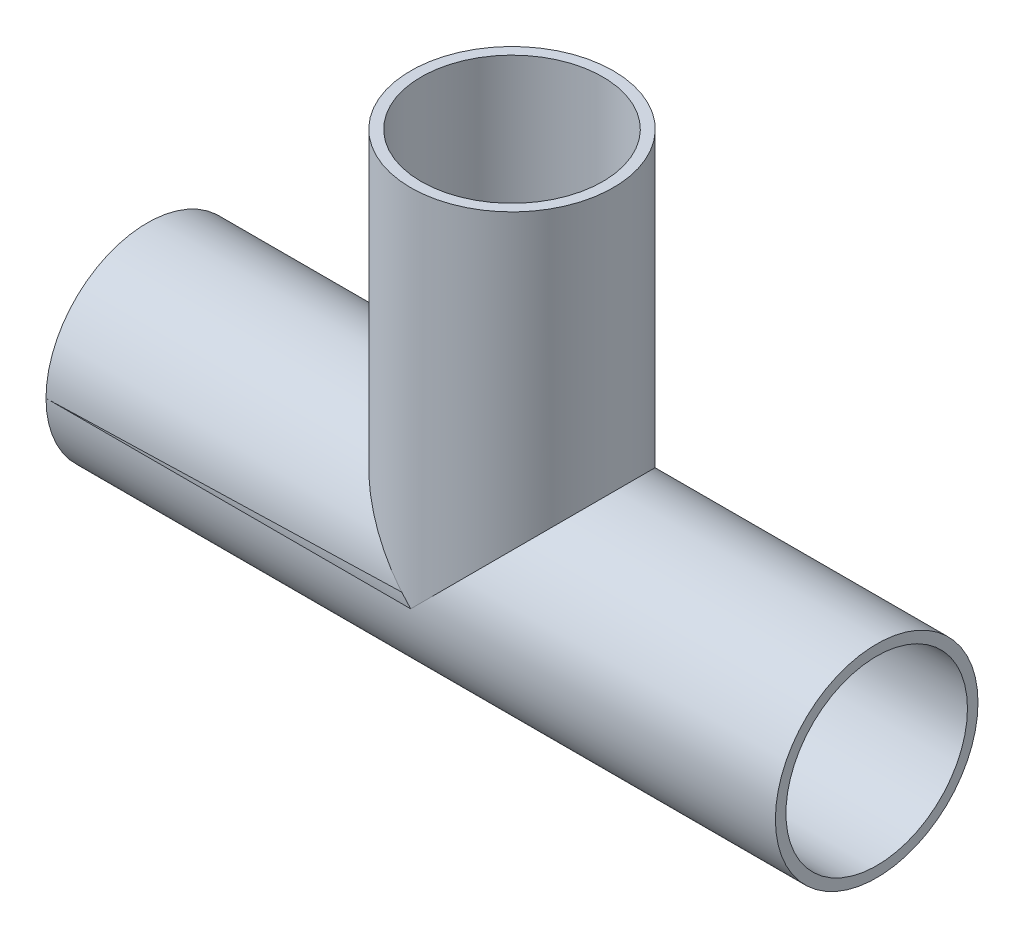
ISO-10303-21;
HEADER;
FILE_DESCRIPTION(('STEP AP214'),'2;1');
FILE_NAME('part.step','',(''),(''),'','','');
FILE_SCHEMA(('AUTOMOTIVE_DESIGN { 1 0 10303 214 1 1 1 1 }'));
ENDSEC;
DATA;
#1=APPLICATION_CONTEXT('core data for automotive mechanical design processes');
#2=APPLICATION_PROTOCOL_DEFINITION('international standard','automotive_design',2000,#1);
#3=PRODUCT_CONTEXT('',#1,'mechanical');
#4=PRODUCT('Part','Part','',(#3));
#5=PRODUCT_RELATED_PRODUCT_CATEGORY('part','',(#4));
#6=PRODUCT_DEFINITION_FORMATION('','',#4);
#7=PRODUCT_DEFINITION_CONTEXT('part definition',#1,'design');
#8=PRODUCT_DEFINITION('design','',#6,#7);
#9=PRODUCT_DEFINITION_SHAPE('','',#8);
#10=(LENGTH_UNIT() NAMED_UNIT(*) SI_UNIT(.MILLI.,.METRE.));
#11=(NAMED_UNIT(*) PLANE_ANGLE_UNIT() SI_UNIT($,.RADIAN.));
#12=(NAMED_UNIT(*) SI_UNIT($,.STERADIAN.) SOLID_ANGLE_UNIT());
#13=UNCERTAINTY_MEASURE_WITH_UNIT(LENGTH_MEASURE(1.E-05),#10,'distance_accuracy_value','');
#14=(GEOMETRIC_REPRESENTATION_CONTEXT(3) GLOBAL_UNCERTAINTY_ASSIGNED_CONTEXT((#13)) GLOBAL_UNIT_ASSIGNED_CONTEXT((#10,
#11,#12)) REPRESENTATION_CONTEXT('',''));
#15=CARTESIAN_POINT('',(0.,0.,0.));
#16=DIRECTION('',(0.,0.,1.));
#17=DIRECTION('',(1.,0.,0.));
#18=AXIS2_PLACEMENT_3D('',#15,#16,#17);
#19=CARTESIAN_POINT('',(0.,57.15,0.));
#20=DIRECTION('',(0.,-1.,0.));
#21=DIRECTION('',(0.,0.,-1.));
#22=AXIS2_PLACEMENT_3D('',#19,#20,#21);
#23=CYLINDRICAL_SURFACE('',#22,15.875);
#24=CARTESIAN_POINT('',(0.,57.15,0.));
#25=DIRECTION('',(0.,1.,0.));
#26=DIRECTION('',(0.,0.,1.));
#27=AXIS2_PLACEMENT_3D('',#24,#25,#26);
#28=CIRCLE('',#27,15.875);
#29=CARTESIAN_POINT('',(0.,57.15,15.875));
#30=VERTEX_POINT('',#29);
#31=EDGE_CURVE('E11',#30,#30,#28,.T.);
#32=ORIENTED_EDGE('',*,*,#31,.F.);
#33=EDGE_LOOP('',(#32));
#34=FACE_BOUND('',#33,.T.);
#35=CARTESIAN_POINT('',(0.,0.,0.));
#36=DIRECTION('',(-0.707106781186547,-0.707106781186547,0.));
#37=DIRECTION('',(0.707106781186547,-0.707106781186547,0.));
#38=AXIS2_PLACEMENT_3D('',#35,#36,#37);
#39=ELLIPSE('',#38,22.4506403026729,15.875);
#40=CARTESIAN_POINT('',(0.,0.,15.875));
#41=VERTEX_POINT('',#40);
#42=CARTESIAN_POINT('',(0.,0.,-15.875));
#43=VERTEX_POINT('',#42);
#44=EDGE_CURVE('E40',#41,#43,#39,.T.);
#45=ORIENTED_EDGE('',*,*,#44,.F.);
#46=CARTESIAN_POINT('',(0.,0.,0.));
#47=DIRECTION('',(0.707106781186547,-0.707106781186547,0.));
#48=DIRECTION('',(-0.707106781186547,-0.707106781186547,0.));
#49=AXIS2_PLACEMENT_3D('',#46,#47,#48);
#50=ELLIPSE('',#49,22.4506403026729,15.875);
#51=EDGE_CURVE('E53',#43,#41,#50,.T.);
#52=ORIENTED_EDGE('',*,*,#51,.F.);
#53=EDGE_LOOP('',(#45,#52));
#54=FACE_BOUND('',#53,.T.);
#55=ADVANCED_FACE('F33',(#34,#54),#23,.T.);
#56=CARTESIAN_POINT('',(0.,57.15,0.));
#57=DIRECTION('',(0.,1.,0.));
#58=DIRECTION('',(0.,0.,1.));
#59=AXIS2_PLACEMENT_3D('',#56,#57,#58);
#60=PLANE('',#59);
#61=CARTESIAN_POINT('',(0.,57.15,0.));
#62=DIRECTION('',(0.,1.,0.));
#63=DIRECTION('',(0.,0.,1.));
#64=AXIS2_PLACEMENT_3D('',#61,#62,#63);
#65=CIRCLE('',#64,14.224);
#66=CARTESIAN_POINT('',(0.,57.15,14.224));
#67=VERTEX_POINT('',#66);
#68=EDGE_CURVE('E65',#67,#67,#65,.T.);
#69=ORIENTED_EDGE('',*,*,#68,.F.);
#70=EDGE_LOOP('',(#69));
#71=FACE_BOUND('',#70,.T.);
#72=ORIENTED_EDGE('',*,*,#31,.T.);
#73=EDGE_LOOP('',(#72));
#74=FACE_BOUND('',#73,.T.);
#75=ADVANCED_FACE('F80',(#71,#74),#60,.T.);
#76=CARTESIAN_POINT('',(57.15,0.,0.));
#77=DIRECTION('',(-1.,0.,0.));
#78=DIRECTION('',(0.,0.,1.));
#79=AXIS2_PLACEMENT_3D('',#76,#77,#78);
#80=CYLINDRICAL_SURFACE('',#79,15.875);
#81=CARTESIAN_POINT('',(-57.15,0.,0.));
#82=DIRECTION('',(1.,0.,0.));
#83=DIRECTION('',(0.,0.,-1.));
#84=AXIS2_PLACEMENT_3D('',#81,#82,#83);
#85=CIRCLE('',#84,15.875);
#86=CARTESIAN_POINT('',(-57.15,0.,-15.875));
#87=VERTEX_POINT('',#86);
#88=EDGE_CURVE('E68',#87,#87,#85,.T.);
#89=ORIENTED_EDGE('',*,*,#88,.T.);
#90=EDGE_LOOP('',(#89));
#91=FACE_BOUND('',#90,.T.);
#92=CARTESIAN_POINT('',(57.15,0.,0.));
#93=DIRECTION('',(1.,0.,0.));
#94=DIRECTION('',(0.,0.,-1.));
#95=AXIS2_PLACEMENT_3D('',#92,#93,#94);
#96=CIRCLE('',#95,15.875);
#97=CARTESIAN_POINT('',(57.15,0.,-15.875));
#98=VERTEX_POINT('',#97);
#99=EDGE_CURVE('E72',#98,#98,#96,.T.);
#100=ORIENTED_EDGE('',*,*,#99,.F.);
#101=EDGE_LOOP('',(#100));
#102=FACE_BOUND('',#101,.T.);
#103=ORIENTED_EDGE('',*,*,#51,.T.);
#104=ORIENTED_EDGE('',*,*,#44,.T.);
#105=EDGE_LOOP('',(#103,#104));
#106=FACE_BOUND('',#105,.T.);
#107=ADVANCED_FACE('F78',(#91,#102,#106),#80,.T.);
#108=CARTESIAN_POINT('',(57.15,0.,0.));
#109=DIRECTION('',(1.,0.,0.));
#110=DIRECTION('',(0.,0.,-1.));
#111=AXIS2_PLACEMENT_3D('',#108,#109,#110);
#112=PLANE('',#111);
#113=CARTESIAN_POINT('',(57.15,0.,0.));
#114=DIRECTION('',(1.,0.,0.));
#115=DIRECTION('',(0.,0.,-1.));
#116=AXIS2_PLACEMENT_3D('',#113,#114,#115);
#117=CIRCLE('',#116,14.224);
#118=CARTESIAN_POINT('',(57.15,0.,-14.224));
#119=VERTEX_POINT('',#118);
#120=EDGE_CURVE('E112',#119,#119,#117,.T.);
#121=ORIENTED_EDGE('',*,*,#120,.F.);
#122=EDGE_LOOP('',(#121));
#123=FACE_BOUND('',#122,.T.);
#124=ORIENTED_EDGE('',*,*,#99,.T.);
#125=EDGE_LOOP('',(#124));
#126=FACE_BOUND('',#125,.T.);
#127=ADVANCED_FACE('F91',(#123,#126),#112,.T.);
#128=CARTESIAN_POINT('',(-57.15,0.,0.));
#129=DIRECTION('',(1.,0.,0.));
#130=DIRECTION('',(0.,0.,-1.));
#131=AXIS2_PLACEMENT_3D('',#128,#129,#130);
#132=PLANE('',#131);
#133=CARTESIAN_POINT('',(-57.15,0.,0.));
#134=DIRECTION('',(1.,0.,0.));
#135=DIRECTION('',(0.,0.,-1.));
#136=AXIS2_PLACEMENT_3D('',#133,#134,#135);
#137=CIRCLE('',#136,14.224);
#138=CARTESIAN_POINT('',(-57.15,0.,-14.224));
#139=VERTEX_POINT('',#138);
#140=EDGE_CURVE('E61',#139,#139,#137,.T.);
#141=ORIENTED_EDGE('',*,*,#140,.T.);
#142=EDGE_LOOP('',(#141));
#143=FACE_BOUND('',#142,.T.);
#144=ORIENTED_EDGE('',*,*,#88,.F.);
#145=EDGE_LOOP('',(#144));
#146=FACE_BOUND('',#145,.T.);
#147=ADVANCED_FACE('F96',(#143,#146),#132,.F.);
#148=CARTESIAN_POINT('',(0.,0.,0.));
#149=DIRECTION('',(0.,1.,0.));
#150=DIRECTION('',(0.,0.,1.));
#151=AXIS2_PLACEMENT_3D('',#148,#149,#150);
#152=CYLINDRICAL_SURFACE('',#151,14.224);
#153=CARTESIAN_POINT('',(0.,0.,0.));
#154=DIRECTION('',(-0.707106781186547,0.707106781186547,0.));
#155=DIRECTION('',(0.707106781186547,0.707106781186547,0.));
#156=AXIS2_PLACEMENT_3D('',#153,#154,#155);
#157=ELLIPSE('',#156,20.1157737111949,14.224);
#158=CARTESIAN_POINT('',(0.,0.,-14.224));
#159=VERTEX_POINT('',#158);
#160=CARTESIAN_POINT('',(0.,0.,14.224));
#161=VERTEX_POINT('',#160);
#162=EDGE_CURVE('E58',#159,#161,#157,.F.);
#163=ORIENTED_EDGE('',*,*,#162,.T.);
#164=CARTESIAN_POINT('',(0.,0.,0.));
#165=DIRECTION('',(0.707106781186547,0.707106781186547,0.));
#166=DIRECTION('',(-0.707106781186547,0.707106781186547,0.));
#167=AXIS2_PLACEMENT_3D('',#164,#165,#166);
#168=ELLIPSE('',#167,20.1157737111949,14.224);
#169=EDGE_CURVE('E46',#161,#159,#168,.F.);
#170=ORIENTED_EDGE('',*,*,#169,.T.);
#171=EDGE_LOOP('',(#163,#170));
#172=FACE_BOUND('',#171,.T.);
#173=ORIENTED_EDGE('',*,*,#68,.T.);
#174=EDGE_LOOP('',(#173));
#175=FACE_BOUND('',#174,.T.);
#176=ADVANCED_FACE('F63',(#172,#175),#152,.F.);
#177=CARTESIAN_POINT('',(-57.15,0.,0.));
#178=DIRECTION('',(1.,0.,0.));
#179=DIRECTION('',(0.,0.,-1.));
#180=AXIS2_PLACEMENT_3D('',#177,#178,#179);
#181=CYLINDRICAL_SURFACE('',#180,14.224);
#182=ORIENTED_EDGE('',*,*,#120,.T.);
#183=EDGE_LOOP('',(#182));
#184=FACE_BOUND('',#183,.T.);
#185=ORIENTED_EDGE('',*,*,#140,.F.);
#186=EDGE_LOOP('',(#185));
#187=FACE_BOUND('',#186,.T.);
#188=ORIENTED_EDGE('',*,*,#162,.F.);
#189=ORIENTED_EDGE('',*,*,#169,.F.);
#190=EDGE_LOOP('',(#188,#189));
#191=FACE_BOUND('',#190,.T.);
#192=ADVANCED_FACE('F59',(#184,#187,#191),#181,.F.);
#193=CLOSED_SHELL('',(#55,#75,#107,#127,#147,#176,#192));
#194=MANIFOLD_SOLID_BREP('B2',#193);
#195=ADVANCED_BREP_SHAPE_REPRESENTATION('',(#18,#194),#14);
#196=SHAPE_DEFINITION_REPRESENTATION(#9,#195);
ENDSEC;
END-ISO-10303-21;
